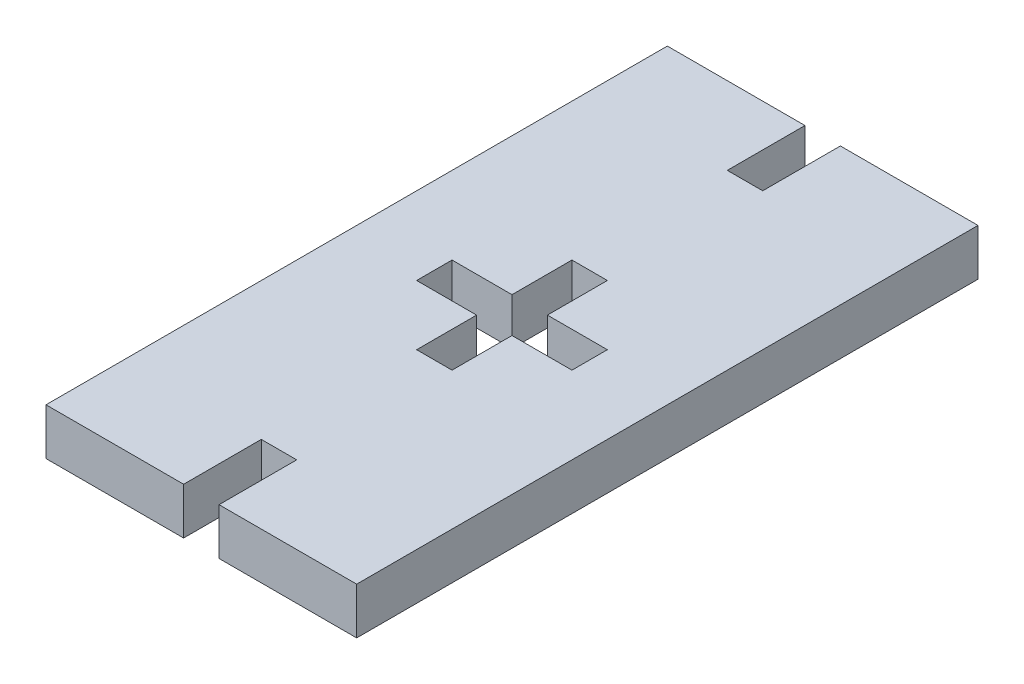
from build123d import *

# Parameters (mm, degrees)
SKETCH1_W           = 20
SKETCH1_H           = 40
BOSS_EXTRUDE1_DEPTH = 3
SKETCH4_W           = 2.28
SKETCH4_H           = 10
CUT_EXTRUDE8_DEPTH  = 3
SKETCH5_W           = 10
SKETCH5_H           = 2.28
CUT_EXTRUDE9_DEPTH  = 10
SKETCH6_W           = 2.28
SKETCH6_H           = 10
CUT_EXTRUDE10_DEPTH = 10


with BuildPart() as part:
    # Sketch1 → Boss-Extrude1 (new body)
    with BuildSketch(Plane(origin=(0, 0, 0), x_dir=(1, 0, 0), z_dir=(0, 1, 0))):
        Rectangle(SKETCH1_W, SKETCH1_H)
    extrude(amount=BOSS_EXTRUDE1_DEPTH)

    # Sketch4 → Cut-Extrude8 (cut)
    with BuildSketch(Plane(origin=(0, 3, 0), x_dir=(1, 0, 0), z_dir=(0, 1, 0))):
        with Locations((0, 20)):
            Rectangle(SKETCH4_W, SKETCH4_H)
        with Locations((0, -20)):
            Rectangle(SKETCH4_W, SKETCH4_H)
    extrude(amount=-CUT_EXTRUDE8_DEPTH, mode=Mode.SUBTRACT)

    # Sketch5 → Cut-Extrude9 (cut)
    with BuildSketch(Plane(origin=(0, 3, 0), x_dir=(1, 0, 0), z_dir=(0, 1, 0))):
        Rectangle(SKETCH5_W, SKETCH5_H)
    extrude(amount=-CUT_EXTRUDE9_DEPTH, mode=Mode.SUBTRACT)

    # Sketch6 → Cut-Extrude10 (cut)
    with BuildSketch(Plane(origin=(0, 3, 0), x_dir=(1, 0, 0), z_dir=(0, 1, 0))):
        Rectangle(SKETCH6_W, SKETCH6_H)
    extrude(amount=-CUT_EXTRUDE10_DEPTH, mode=Mode.SUBTRACT)


solid = part.part
